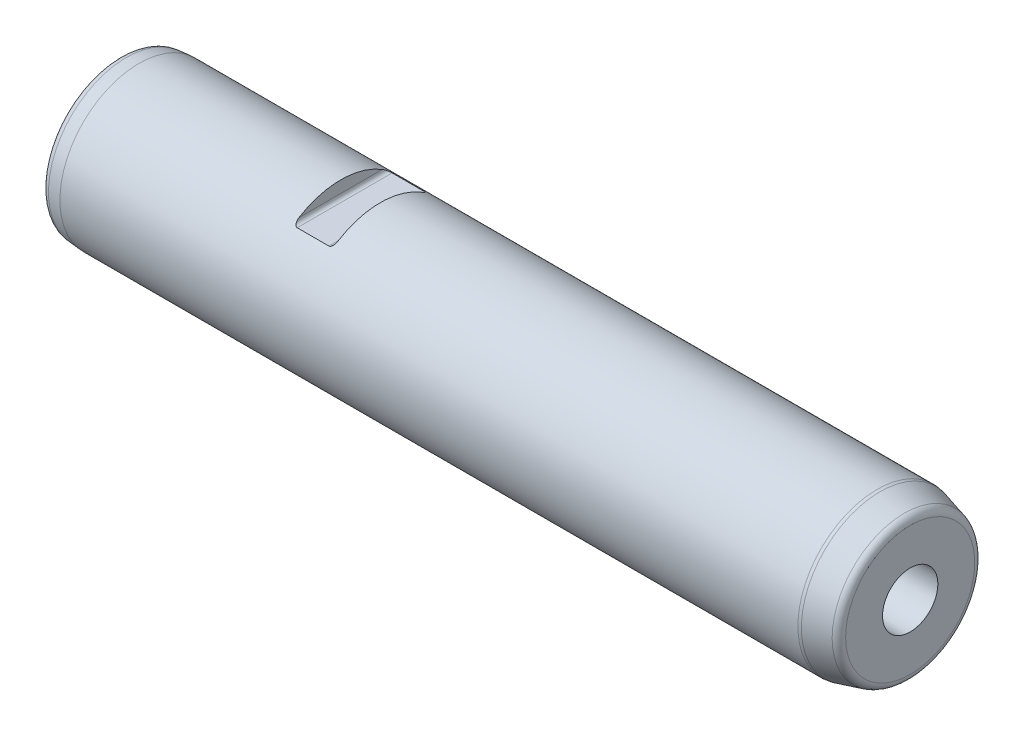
ISO-10303-21;
HEADER;
FILE_DESCRIPTION(('STEP AP214'),'2;1');
FILE_NAME('part.step','',(''),(''),'','','');
FILE_SCHEMA(('AUTOMOTIVE_DESIGN { 1 0 10303 214 1 1 1 1 }'));
ENDSEC;
DATA;
#1=APPLICATION_CONTEXT('core data for automotive mechanical design processes');
#2=APPLICATION_PROTOCOL_DEFINITION('international standard','automotive_design',2000,#1);
#3=PRODUCT_CONTEXT('',#1,'mechanical');
#4=PRODUCT('Part','Part','',(#3));
#5=PRODUCT_RELATED_PRODUCT_CATEGORY('part','',(#4));
#6=PRODUCT_DEFINITION_FORMATION('','',#4);
#7=PRODUCT_DEFINITION_CONTEXT('part definition',#1,'design');
#8=PRODUCT_DEFINITION('design','',#6,#7);
#9=PRODUCT_DEFINITION_SHAPE('','',#8);
#10=(LENGTH_UNIT() NAMED_UNIT(*) SI_UNIT(.MILLI.,.METRE.));
#11=(NAMED_UNIT(*) PLANE_ANGLE_UNIT() SI_UNIT($,.RADIAN.));
#12=(NAMED_UNIT(*) SI_UNIT($,.STERADIAN.) SOLID_ANGLE_UNIT());
#13=UNCERTAINTY_MEASURE_WITH_UNIT(LENGTH_MEASURE(1.E-05),#10,'distance_accuracy_value','');
#14=(GEOMETRIC_REPRESENTATION_CONTEXT(3) GLOBAL_UNCERTAINTY_ASSIGNED_CONTEXT((#13)) GLOBAL_UNIT_ASSIGNED_CONTEXT((#10,
#11,#12)) REPRESENTATION_CONTEXT('',''));
#15=CARTESIAN_POINT('',(0.,0.,0.));
#16=DIRECTION('',(0.,0.,1.));
#17=DIRECTION('',(1.,0.,0.));
#18=AXIS2_PLACEMENT_3D('',#15,#16,#17);
#19=CARTESIAN_POINT('',(0.,0.,0.));
#20=DIRECTION('',(1.,0.,0.));
#21=DIRECTION('',(0.,0.,-1.));
#22=AXIS2_PLACEMENT_3D('',#19,#20,#21);
#23=PLANE('',#22);
#24=CARTESIAN_POINT('',(0.,0.,0.));
#25=DIRECTION('',(1.,0.,0.));
#26=DIRECTION('',(0.,0.,-1.));
#27=AXIS2_PLACEMENT_3D('',#24,#25,#26);
#28=CIRCLE('',#27,17.7298943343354);
#29=CARTESIAN_POINT('',(0.,0.,-17.7298943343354));
#30=VERTEX_POINT('',#29);
#31=EDGE_CURVE('E160',#30,#30,#28,.F.);
#32=ORIENTED_EDGE('',*,*,#31,.T.);
#33=EDGE_LOOP('',(#32));
#34=FACE_BOUND('',#33,.T.);
#35=ADVANCED_FACE('F15',(#34),#23,.F.);
#36=CARTESIAN_POINT('',(0.,0.,0.));
#37=DIRECTION('',(-1.,0.,0.));
#38=DIRECTION('',(0.,0.,1.));
#39=AXIS2_PLACEMENT_3D('',#36,#37,#38);
#40=CYLINDRICAL_SURFACE('',#39,20.);
#41=CARTESIAN_POINT('',(65.,16.,-12.));
#42=CARTESIAN_POINT('',(65.0203975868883,15.9999962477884,-12.0000045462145));
#43=CARTESIAN_POINT('',(65.0407804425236,16.0006247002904,-11.9991670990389));
#44=CARTESIAN_POINT('',(65.0813146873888,16.0031055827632,-11.9958583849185));
#45=CARTESIAN_POINT('',(65.1014663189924,16.004956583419,-11.993389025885));
#46=CARTESIAN_POINT('',(65.1608545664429,16.0122253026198,-11.9836850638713));
#47=CARTESIAN_POINT('',(65.1995323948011,16.0193609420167,-11.9741518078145));
#48=CARTESIAN_POINT('',(65.2739645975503,16.037497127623,-11.9498497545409));
#49=CARTESIAN_POINT('',(65.3097307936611,16.0484809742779,-11.9351035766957));
#50=CARTESIAN_POINT('',(65.3781242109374,16.0735266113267,-11.9013522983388));
#51=CARTESIAN_POINT('',(65.41074138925,16.087597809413,-11.8823341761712));
#52=CARTESIAN_POINT('',(65.4887324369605,16.1259889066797,-11.8302152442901));
#53=CARTESIAN_POINT('',(65.5318948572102,16.1518280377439,-11.7949407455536));
#54=CARTESIAN_POINT('',(65.6109129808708,16.2068340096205,-11.7192462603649));
#55=CARTESIAN_POINT('',(65.6467545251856,16.2360071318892,-11.678816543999));
#56=CARTESIAN_POINT('',(65.7058021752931,16.2906763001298,-11.6023981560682));
#57=CARTESIAN_POINT('',(65.7301168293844,16.3158314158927,-11.567005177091));
#58=CARTESIAN_POINT('',(65.774915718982,16.3670212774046,-11.4944592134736));
#59=CARTESIAN_POINT('',(65.7953974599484,16.3930565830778,-11.4573051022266));
#60=CARTESIAN_POINT('',(65.8518244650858,16.4721604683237,-11.343563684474));
#61=CARTESIAN_POINT('',(65.8825725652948,16.526051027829,-11.2649424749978));
#62=CARTESIAN_POINT('',(65.9240070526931,16.615638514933,-11.1321438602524));
#63=CARTESIAN_POINT('',(65.9379569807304,16.6512330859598,-11.0788360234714));
#64=CARTESIAN_POINT('',(65.9614191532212,16.7223722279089,-10.9711632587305));
#65=CARTESIAN_POINT('',(65.9709289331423,16.7579167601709,-10.9167977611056));
#66=CARTESIAN_POINT('',(65.9857688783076,16.8281581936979,-10.808200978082));
#67=CARTESIAN_POINT('',(65.9911623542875,16.862859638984,-10.7539810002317));
#68=CARTESIAN_POINT('',(65.998268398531,16.9317984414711,-10.6451097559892));
#69=CARTESIAN_POINT('',(65.999986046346,16.9660363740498,-10.5904591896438));
#70=CARTESIAN_POINT('',(66.,17.,-10.5356537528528));
#71=B_SPLINE_CURVE_WITH_KNOTS('',3,(#41,#42,#43,#44,#45,#46,#47,#48,#49,#50,#51,#52,#53,#54,#55,
#56,#57,#58,#59,#60,#61,#62,#63,#64,#65,#66,#67,#68,#69,#70),.UNSPECIFIED.,.F.,.F.,(4,2,2,2,2,2,
2,2,2,2,2,2,2,2,4),(0.,0.0611385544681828,0.122205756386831,0.242843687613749,0.362964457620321,
0.483456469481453,0.66674777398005,0.850390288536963,0.999479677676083,1.14866576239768,
1.44807901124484,1.6447520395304,1.84153410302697,2.03522492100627,2.22864790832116),.UNSPECIFIED.);
#72=CARTESIAN_POINT('',(65.,16.,-12.));
#73=VERTEX_POINT('',#72);
#74=CARTESIAN_POINT('',(66.,17.,-10.5356537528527));
#75=VERTEX_POINT('',#74);
#76=EDGE_CURVE('E206',#73,#75,#71,.T.);
#77=ORIENTED_EDGE('',*,*,#76,.T.);
#78=CARTESIAN_POINT('',(66.,0.,0.));
#79=DIRECTION('',(1.,0.,0.));
#80=DIRECTION('',(0.,0.,-1.));
#81=AXIS2_PLACEMENT_3D('',#78,#79,#80);
#82=CIRCLE('',#81,20.);
#83=CARTESIAN_POINT('',(66.,17.,10.5356537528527));
#84=VERTEX_POINT('',#83);
#85=EDGE_CURVE('E9',#75,#84,#82,.T.);
#86=ORIENTED_EDGE('',*,*,#85,.T.);
#87=CARTESIAN_POINT('',(66.,17.,10.5356537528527));
#88=CARTESIAN_POINT('',(65.9999580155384,16.9556282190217,10.6072606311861));
#89=CARTESIAN_POINT('',(65.9970414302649,16.9107662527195,10.6786284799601));
#90=CARTESIAN_POINT('',(65.9847801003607,16.8201915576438,10.8207316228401));
#91=CARTESIAN_POINT('',(65.9754049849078,16.7744758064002,10.8914623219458));
#92=CARTESIAN_POINT('',(65.9494193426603,16.6823378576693,11.0320779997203));
#93=CARTESIAN_POINT('',(65.9327445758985,16.6359130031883,11.1019496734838));
#94=CARTESIAN_POINT('',(65.8911331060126,16.5434346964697,11.2392876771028));
#95=CARTESIAN_POINT('',(65.8662148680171,16.4973806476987,11.3067590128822));
#96=CARTESIAN_POINT('',(65.8154112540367,16.4198497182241,11.4189199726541));
#97=CARTESIAN_POINT('',(65.7919526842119,16.3880587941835,11.4644877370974));
#98=CARTESIAN_POINT('',(65.739534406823,16.3256491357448,11.5531862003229));
#99=CARTESIAN_POINT('',(65.7105793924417,16.2950294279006,11.596318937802));
#100=CARTESIAN_POINT('',(65.6461040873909,16.2354774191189,11.6795510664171));
#101=CARTESIAN_POINT('',(65.610528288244,16.2065623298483,11.7196204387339));
#102=CARTESIAN_POINT('',(65.5321445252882,16.1520057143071,11.7946959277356));
#103=CARTESIAN_POINT('',(65.489347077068,16.1263595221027,11.829709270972));
#104=CARTESIAN_POINT('',(65.4114116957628,16.0878834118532,11.8819483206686));
#105=CARTESIAN_POINT('',(65.3783803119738,16.0736117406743,11.9012377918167));
#106=CARTESIAN_POINT('',(65.3090792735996,16.048251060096,11.9354131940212));
#107=CARTESIAN_POINT('',(65.2728207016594,16.0371516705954,11.9503134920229));
#108=CARTESIAN_POINT('',(65.1981046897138,16.0190813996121,11.9745255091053));
#109=CARTESIAN_POINT('',(65.1596911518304,16.0120479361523,11.9839219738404));
#110=CARTESIAN_POINT('',(65.10072428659,16.0048841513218,11.9934856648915));
#111=CARTESIAN_POINT('',(65.0807179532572,16.0030600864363,11.9959190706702));
#112=CARTESIAN_POINT('',(65.040479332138,16.0006154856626,11.9991793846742));
#113=CARTESIAN_POINT('',(65.0202468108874,15.9999963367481,12.0000044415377));
#114=CARTESIAN_POINT('',(65.,16.,12.));
#115=B_SPLINE_CURVE_WITH_KNOTS('',3,(#87,#88,#89,#90,#91,#92,#93,#94,#95,#96,#97,#98,#99,#100,
#101,#102,#103,#104,#105,#106,#107,#108,#109,#110,#111,#112,#113,#114),.UNSPECIFIED.,.F.,.F.,(4,
2,2,2,2,2,2,2,2,2,2,2,2,4),(0.,0.252754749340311,0.506706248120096,0.762939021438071,
1.01860168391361,1.19928577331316,1.37981627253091,1.56193473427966,1.74379026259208,
1.86586776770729,1.98754112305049,2.10728809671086,2.16790599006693,2.22859361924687),.UNSPECIFIED.);
#116=CARTESIAN_POINT('',(65.,16.,12.));
#117=VERTEX_POINT('',#116);
#118=EDGE_CURVE('E23',#84,#117,#115,.T.);
#119=ORIENTED_EDGE('',*,*,#118,.T.);
#120=DIRECTION('',(-1.,0.,0.));
#121=VECTOR('',#120,1.);
#122=CARTESIAN_POINT('',(0.,16.,12.));
#123=LINE('',#122,#121);
#124=CARTESIAN_POINT('',(57.,16.,12.));
#125=VERTEX_POINT('',#124);
#126=EDGE_CURVE('E74',#117,#125,#123,.T.);
#127=ORIENTED_EDGE('',*,*,#126,.T.);
#128=CARTESIAN_POINT('',(57.,16.,12.));
#129=CARTESIAN_POINT('',(56.9796024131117,15.9999962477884,12.0000045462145));
#130=CARTESIAN_POINT('',(56.9592195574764,16.0006247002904,11.9991670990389));
#131=CARTESIAN_POINT('',(56.9186853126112,16.0031055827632,11.9958583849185));
#132=CARTESIAN_POINT('',(56.8985336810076,16.004956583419,11.993389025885));
#133=CARTESIAN_POINT('',(56.839145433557,16.0122253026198,11.9836850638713));
#134=CARTESIAN_POINT('',(56.8004676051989,16.0193609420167,11.9741518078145));
#135=CARTESIAN_POINT('',(56.7260354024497,16.037497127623,11.9498497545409));
#136=CARTESIAN_POINT('',(56.6902692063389,16.0484809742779,11.9351035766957));
#137=CARTESIAN_POINT('',(56.6218757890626,16.0735266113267,11.9013522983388));
#138=CARTESIAN_POINT('',(56.58925861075,16.087597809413,11.8823341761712));
#139=CARTESIAN_POINT('',(56.5112675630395,16.1259889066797,11.8302152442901));
#140=CARTESIAN_POINT('',(56.4681051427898,16.1518280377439,11.7949407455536));
#141=CARTESIAN_POINT('',(56.3890870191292,16.2068340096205,11.7192462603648));
#142=CARTESIAN_POINT('',(56.3532454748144,16.2360071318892,11.678816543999));
#143=CARTESIAN_POINT('',(56.2941978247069,16.2906763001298,11.6023981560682));
#144=CARTESIAN_POINT('',(56.2698831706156,16.3158314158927,11.567005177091));
#145=CARTESIAN_POINT('',(56.225084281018,16.3670212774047,11.4944592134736));
#146=CARTESIAN_POINT('',(56.2046025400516,16.3930565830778,11.4573051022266));
#147=CARTESIAN_POINT('',(56.1481755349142,16.4721604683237,11.343563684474));
#148=CARTESIAN_POINT('',(56.1174274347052,16.5260510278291,11.2649424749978));
#149=CARTESIAN_POINT('',(56.0759929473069,16.6156385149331,11.1321438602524));
#150=CARTESIAN_POINT('',(56.0620430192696,16.6512330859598,11.0788360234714));
#151=CARTESIAN_POINT('',(56.0385808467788,16.7223722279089,10.9711632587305));
#152=CARTESIAN_POINT('',(56.0290710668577,16.7579167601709,10.9167977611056));
#153=CARTESIAN_POINT('',(56.0142311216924,16.8281581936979,10.808200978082));
#154=CARTESIAN_POINT('',(56.0088376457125,16.862859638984,10.7539810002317));
#155=CARTESIAN_POINT('',(56.001731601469,16.9317984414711,10.6451097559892));
#156=CARTESIAN_POINT('',(56.000013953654,16.9660363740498,10.5904591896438));
#157=CARTESIAN_POINT('',(56.,17.,10.5356537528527));
#158=B_SPLINE_CURVE_WITH_KNOTS('',3,(#128,#129,#130,#131,#132,#133,#134,#135,#136,#137,#138,
#139,#140,#141,#142,#143,#144,#145,#146,#147,#148,#149,#150,#151,#152,#153,#154,#155,#156,#157),
.UNSPECIFIED.,.F.,.F.,(4,2,2,2,2,2,2,2,2,2,2,2,2,2,4),(0.,0.061138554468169,0.122205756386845,
0.242843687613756,0.362964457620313,0.483456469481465,0.666747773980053,0.850390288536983,
0.999479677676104,1.14866576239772,1.4480790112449,1.64475203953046,1.841534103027,
2.03522492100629,2.22864790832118),.UNSPECIFIED.);
#159=CARTESIAN_POINT('',(56.,17.,10.5356537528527));
#160=VERTEX_POINT('',#159);
#161=EDGE_CURVE('E65',#125,#160,#158,.T.);
#162=ORIENTED_EDGE('',*,*,#161,.T.);
#163=CARTESIAN_POINT('',(56.,0.,0.));
#164=DIRECTION('',(-1.,0.,0.));
#165=DIRECTION('',(0.,0.,1.));
#166=AXIS2_PLACEMENT_3D('',#163,#164,#165);
#167=CIRCLE('',#166,20.);
#168=CARTESIAN_POINT('',(56.,17.,-10.5356537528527));
#169=VERTEX_POINT('',#168);
#170=EDGE_CURVE('E54',#160,#169,#167,.T.);
#171=ORIENTED_EDGE('',*,*,#170,.T.);
#172=CARTESIAN_POINT('',(56.,17.,-10.5356537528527));
#173=CARTESIAN_POINT('',(56.0000419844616,16.9556282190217,-10.6072606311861));
#174=CARTESIAN_POINT('',(56.0029585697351,16.9107662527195,-10.6786284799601));
#175=CARTESIAN_POINT('',(56.0152198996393,16.8201915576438,-10.8207316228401));
#176=CARTESIAN_POINT('',(56.0245950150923,16.7744758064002,-10.8914623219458));
#177=CARTESIAN_POINT('',(56.0505806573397,16.6823378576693,-11.0320779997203));
#178=CARTESIAN_POINT('',(56.0672554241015,16.6359130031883,-11.1019496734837));
#179=CARTESIAN_POINT('',(56.1088668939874,16.5434346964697,-11.2392876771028));
#180=CARTESIAN_POINT('',(56.1337851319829,16.4973806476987,-11.3067590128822));
#181=CARTESIAN_POINT('',(56.1845887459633,16.4198497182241,-11.4189199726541));
#182=CARTESIAN_POINT('',(56.2080473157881,16.3880587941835,-11.4644877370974));
#183=CARTESIAN_POINT('',(56.260465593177,16.3256491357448,-11.5531862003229));
#184=CARTESIAN_POINT('',(56.2894206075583,16.2950294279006,-11.596318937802));
#185=CARTESIAN_POINT('',(56.3538959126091,16.2354774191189,-11.6795510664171));
#186=CARTESIAN_POINT('',(56.389471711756,16.2065623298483,-11.719620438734));
#187=CARTESIAN_POINT('',(56.4678554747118,16.1520057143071,-11.7946959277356));
#188=CARTESIAN_POINT('',(56.510652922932,16.1263595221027,-11.829709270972));
#189=CARTESIAN_POINT('',(56.5885883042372,16.0878834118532,-11.8819483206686));
#190=CARTESIAN_POINT('',(56.6216196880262,16.0736117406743,-11.9012377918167));
#191=CARTESIAN_POINT('',(56.6909207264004,16.048251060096,-11.9354131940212));
#192=CARTESIAN_POINT('',(56.7271792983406,16.0371516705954,-11.9503134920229));
#193=CARTESIAN_POINT('',(56.8018953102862,16.0190813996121,-11.9745255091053));
#194=CARTESIAN_POINT('',(56.8403088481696,16.0120479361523,-11.9839219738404));
#195=CARTESIAN_POINT('',(56.89927571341,16.0048841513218,-11.9934856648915));
#196=CARTESIAN_POINT('',(56.9192820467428,16.0030600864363,-11.9959190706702));
#197=CARTESIAN_POINT('',(56.959520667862,16.0006154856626,-11.9991793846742));
#198=CARTESIAN_POINT('',(56.9797531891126,15.9999963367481,-12.0000044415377));
#199=CARTESIAN_POINT('',(57.,16.,-12.));
#200=B_SPLINE_CURVE_WITH_KNOTS('',3,(#172,#173,#174,#175,#176,#177,#178,#179,#180,#181,#182,
#183,#184,#185,#186,#187,#188,#189,#190,#191,#192,#193,#194,#195,#196,#197,#198,#199),
.UNSPECIFIED.,.F.,.F.,(4,2,2,2,2,2,2,2,2,2,2,2,2,4),(0.,0.252754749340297,0.50670624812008,
0.76293902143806,1.0186016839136,1.19928577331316,1.37981627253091,1.56193473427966,
1.74379026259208,1.86586776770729,1.98754112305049,2.10728809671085,2.16790599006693,
2.22859361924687),.UNSPECIFIED.);
#201=CARTESIAN_POINT('',(57.,16.,-12.));
#202=VERTEX_POINT('',#201);
#203=EDGE_CURVE('E59',#169,#202,#200,.T.);
#204=ORIENTED_EDGE('',*,*,#203,.T.);
#205=DIRECTION('',(-1.,0.,0.));
#206=VECTOR('',#205,1.);
#207=CARTESIAN_POINT('',(0.,16.,-12.));
#208=LINE('',#207,#206);
#209=EDGE_CURVE('E75',#202,#73,#208,.F.);
#210=ORIENTED_EDGE('',*,*,#209,.T.);
#211=EDGE_LOOP('',(#77,#86,#119,#127,#162,#171,#204,#210));
#212=FACE_BOUND('',#211,.T.);
#213=CARTESIAN_POINT('',(5.00000000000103,0.,0.));
#214=DIRECTION('',(1.,0.,0.));
#215=DIRECTION('',(0.,0.,-1.));
#216=AXIS2_PLACEMENT_3D('',#213,#214,#215);
#217=CIRCLE('',#216,20.);
#218=CARTESIAN_POINT('',(5.00000000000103,0.,-20.));
#219=VERTEX_POINT('',#218);
#220=EDGE_CURVE('E159',#219,#219,#217,.T.);
#221=ORIENTED_EDGE('',*,*,#220,.T.);
#222=EDGE_LOOP('',(#221));
#223=FACE_BOUND('',#222,.T.);
#224=CARTESIAN_POINT('',(191.605042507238,0.,0.));
#225=DIRECTION('',(1.,0.,0.));
#226=DIRECTION('',(0.,0.,-1.));
#227=AXIS2_PLACEMENT_3D('',#224,#225,#226);
#228=CIRCLE('',#227,20.);
#229=CARTESIAN_POINT('',(191.605042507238,0.,-20.));
#230=VERTEX_POINT('',#229);
#231=EDGE_CURVE('E177',#230,#230,#228,.F.);
#232=ORIENTED_EDGE('',*,*,#231,.T.);
#233=EDGE_LOOP('',(#232));
#234=FACE_BOUND('',#233,.T.);
#235=ADVANCED_FACE('F71',(#212,#223,#234),#40,.T.);
#236=CARTESIAN_POINT('',(200.,0.,0.));
#237=DIRECTION('',(-1.,0.,0.));
#238=DIRECTION('',(0.,0.,1.));
#239=AXIS2_PLACEMENT_3D('',#236,#237,#238);
#240=CONICAL_SURFACE('',#239,17.856406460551,0.26179938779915);
#241=CARTESIAN_POINT('',(198.517638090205,0.,0.));
#242=DIRECTION('',(1.,0.,0.));
#243=DIRECTION('',(0.,0.,-1.));
#244=AXIS2_PLACEMENT_3D('',#241,#242,#243);
#245=CIRCLE('',#244,18.2536041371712);
#246=CARTESIAN_POINT('',(198.517638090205,0.,-18.2536041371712));
#247=VERTEX_POINT('',#246);
#248=EDGE_CURVE('E165',#247,#247,#245,.F.);
#249=ORIENTED_EDGE('',*,*,#248,.T.);
#250=EDGE_LOOP('',(#249));
#251=FACE_BOUND('',#250,.T.);
#252=CARTESIAN_POINT('',(192.381499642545,0.,0.));
#253=DIRECTION('',(1.,0.,0.));
#254=DIRECTION('',(0.,0.,-1.));
#255=AXIS2_PLACEMENT_3D('',#252,#253,#254);
#256=CIRCLE('',#255,19.8977774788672);
#257=CARTESIAN_POINT('',(192.381499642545,0.,-19.8977774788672));
#258=VERTEX_POINT('',#257);
#259=EDGE_CURVE('E190',#258,#258,#256,.T.);
#260=ORIENTED_EDGE('',*,*,#259,.T.);
#261=EDGE_LOOP('',(#260));
#262=FACE_BOUND('',#261,.T.);
#263=ADVANCED_FACE('F122',(#251,#262),#240,.T.);
#264=CARTESIAN_POINT('',(200.,17.856406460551,0.));
#265=DIRECTION('',(-1.,0.,0.));
#266=DIRECTION('',(0.,0.,1.));
#267=AXIS2_PLACEMENT_3D('',#264,#265,#266);
#268=PLANE('',#267);
#269=CARTESIAN_POINT('',(200.,0.,0.));
#270=DIRECTION('',(1.,0.,0.));
#271=DIRECTION('',(0.,0.,-1.));
#272=AXIS2_PLACEMENT_3D('',#269,#270,#271);
#273=CIRCLE('',#272,7.);
#274=CARTESIAN_POINT('',(200.,0.,-7.));
#275=VERTEX_POINT('',#274);
#276=EDGE_CURVE('E180',#275,#275,#273,.T.);
#277=ORIENTED_EDGE('',*,*,#276,.F.);
#278=EDGE_LOOP('',(#277));
#279=FACE_BOUND('',#278,.T.);
#280=CARTESIAN_POINT('',(200.,0.,0.));
#281=DIRECTION('',(-1.,0.,0.));
#282=DIRECTION('',(0.,0.,1.));
#283=AXIS2_PLACEMENT_3D('',#280,#281,#282);
#284=CIRCLE('',#283,16.3217524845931);
#285=CARTESIAN_POINT('',(200.,0.,16.3217524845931));
#286=VERTEX_POINT('',#285);
#287=EDGE_CURVE('E161',#286,#286,#284,.F.);
#288=ORIENTED_EDGE('',*,*,#287,.T.);
#289=EDGE_LOOP('',(#288));
#290=FACE_BOUND('',#289,.T.);
#291=ADVANCED_FACE('F119',(#279,#290),#268,.F.);
#292=CARTESIAN_POINT('',(191.605042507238,0.,0.));
#293=DIRECTION('',(1.,0.,0.));
#294=DIRECTION('',(0.,0.,-1.));
#295=AXIS2_PLACEMENT_3D('',#292,#293,#294);
#296=TOROIDAL_SURFACE('',#295,17.,3.);
#297=ORIENTED_EDGE('',*,*,#259,.F.);
#298=EDGE_LOOP('',(#297));
#299=FACE_BOUND('',#298,.T.);
#300=ORIENTED_EDGE('',*,*,#231,.F.);
#301=EDGE_LOOP('',(#300));
#302=FACE_BOUND('',#301,.T.);
#303=ADVANCED_FACE('F121',(#299,#302),#296,.T.);
#304=CARTESIAN_POINT('',(198.,0.,0.));
#305=DIRECTION('',(-1.,0.,0.));
#306=DIRECTION('',(0.,0.,1.));
#307=AXIS2_PLACEMENT_3D('',#304,#305,#306);
#308=TOROIDAL_SURFACE('',#307,16.3217524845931,2.);
#309=ORIENTED_EDGE('',*,*,#287,.F.);
#310=EDGE_LOOP('',(#309));
#311=FACE_BOUND('',#310,.T.);
#312=ORIENTED_EDGE('',*,*,#248,.F.);
#313=EDGE_LOOP('',(#312));
#314=FACE_BOUND('',#313,.T.);
#315=ADVANCED_FACE('F142',(#311,#314),#308,.T.);
#316=CARTESIAN_POINT('',(0.,0.,0.));
#317=DIRECTION('',(1.,0.,0.));
#318=DIRECTION('',(0.,0.,-1.));
#319=AXIS2_PLACEMENT_3D('',#316,#317,#318);
#320=CONICAL_SURFACE('',#319,19.5625566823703,0.087266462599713);
#321=CARTESIAN_POINT('',(1.82568851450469,0.,0.));
#322=DIRECTION('',(1.,0.,0.));
#323=DIRECTION('',(0.,0.,-1.));
#324=AXIS2_PLACEMENT_3D('',#321,#322,#323);
#325=CIRCLE('',#324,19.7222837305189);
#326=CARTESIAN_POINT('',(1.82568851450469,0.,-19.7222837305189));
#327=VERTEX_POINT('',#326);
#328=EDGE_CURVE('E60',#327,#327,#325,.T.);
#329=ORIENTED_EDGE('',*,*,#328,.T.);
#330=EDGE_LOOP('',(#329));
#331=FACE_BOUND('',#330,.T.);
#332=ORIENTED_EDGE('',*,*,#220,.F.);
#333=EDGE_LOOP('',(#332));
#334=FACE_BOUND('',#333,.T.);
#335=ADVANCED_FACE('F145',(#331,#334),#320,.T.);
#336=CARTESIAN_POINT('',(2.,0.,0.));
#337=DIRECTION('',(1.,0.,0.));
#338=DIRECTION('',(0.,0.,-1.));
#339=AXIS2_PLACEMENT_3D('',#336,#337,#338);
#340=TOROIDAL_SURFACE('',#339,17.7298943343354,2.);
#341=ORIENTED_EDGE('',*,*,#328,.F.);
#342=EDGE_LOOP('',(#341));
#343=FACE_BOUND('',#342,.T.);
#344=ORIENTED_EDGE('',*,*,#31,.F.);
#345=EDGE_LOOP('',(#344));
#346=FACE_BOUND('',#345,.T.);
#347=ADVANCED_FACE('F17',(#343,#346),#340,.T.);
#348=CARTESIAN_POINT('',(176.,0.,0.));
#349=DIRECTION('',(1.,0.,0.));
#350=DIRECTION('',(0.,0.,-1.));
#351=AXIS2_PLACEMENT_3D('',#348,#349,#350);
#352=PLANE('',#351);
#353=CARTESIAN_POINT('',(176.,0.,0.));
#354=DIRECTION('',(1.,0.,0.));
#355=DIRECTION('',(0.,0.,-1.));
#356=AXIS2_PLACEMENT_3D('',#353,#354,#355);
#357=CIRCLE('',#356,7.);
#358=CARTESIAN_POINT('',(176.,0.,-7.));
#359=VERTEX_POINT('',#358);
#360=EDGE_CURVE('E173',#359,#359,#357,.T.);
#361=ORIENTED_EDGE('',*,*,#360,.T.);
#362=EDGE_LOOP('',(#361));
#363=FACE_BOUND('',#362,.T.);
#364=CARTESIAN_POINT('',(176.,0.,0.));
#365=DIRECTION('',(1.,0.,0.));
#366=DIRECTION('',(0.,0.,-1.));
#367=AXIS2_PLACEMENT_3D('',#364,#365,#366);
#368=CIRCLE('',#367,5.1);
#369=CARTESIAN_POINT('',(176.,0.,-5.1));
#370=VERTEX_POINT('',#369);
#371=EDGE_CURVE('E170',#370,#370,#368,.F.);
#372=ORIENTED_EDGE('',*,*,#371,.T.);
#373=EDGE_LOOP('',(#372));
#374=FACE_BOUND('',#373,.T.);
#375=ADVANCED_FACE('F103',(#363,#374),#352,.T.);
#376=CARTESIAN_POINT('',(176.,0.,0.));
#377=DIRECTION('',(1.,0.,0.));
#378=DIRECTION('',(0.,0.,-1.));
#379=AXIS2_PLACEMENT_3D('',#376,#377,#378);
#380=CYLINDRICAL_SURFACE('',#379,7.);
#381=ORIENTED_EDGE('',*,*,#360,.F.);
#382=EDGE_LOOP('',(#381));
#383=FACE_BOUND('',#382,.T.);
#384=ORIENTED_EDGE('',*,*,#276,.T.);
#385=EDGE_LOOP('',(#384));
#386=FACE_BOUND('',#385,.T.);
#387=ADVANCED_FACE('F106',(#383,#386),#380,.F.);
#388=CARTESIAN_POINT('',(170.,0.,0.));
#389=DIRECTION('',(1.,0.,0.));
#390=DIRECTION('',(0.,0.,-1.));
#391=AXIS2_PLACEMENT_3D('',#388,#389,#390);
#392=CONICAL_SURFACE('',#391,5.1,1.0471975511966);
#393=CARTESIAN_POINT('',(167.055513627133,0.,0.));
#394=VERTEX_POINT('',#393);
#395=VERTEX_LOOP('',#394);
#396=FACE_BOUND('',#395,.T.);
#397=CARTESIAN_POINT('',(170.,0.,0.));
#398=DIRECTION('',(1.,0.,0.));
#399=DIRECTION('',(0.,0.,-1.));
#400=AXIS2_PLACEMENT_3D('',#397,#398,#399);
#401=CIRCLE('',#400,5.1);
#402=CARTESIAN_POINT('',(170.,0.,-5.1));
#403=VERTEX_POINT('',#402);
#404=EDGE_CURVE('E172',#403,#403,#401,.T.);
#405=ORIENTED_EDGE('',*,*,#404,.T.);
#406=EDGE_LOOP('',(#405));
#407=FACE_BOUND('',#406,.T.);
#408=ADVANCED_FACE('F110',(#396,#407),#392,.F.);
#409=CARTESIAN_POINT('',(200.,0.,0.));
#410=DIRECTION('',(1.,0.,0.));
#411=DIRECTION('',(0.,0.,-1.));
#412=AXIS2_PLACEMENT_3D('',#409,#410,#411);
#413=CYLINDRICAL_SURFACE('',#412,5.1);
#414=ORIENTED_EDGE('',*,*,#404,.F.);
#415=EDGE_LOOP('',(#414));
#416=FACE_BOUND('',#415,.T.);
#417=ORIENTED_EDGE('',*,*,#371,.F.);
#418=EDGE_LOOP('',(#417));
#419=FACE_BOUND('',#418,.T.);
#420=ADVANCED_FACE('F112',(#416,#419),#413,.F.);
#421=CARTESIAN_POINT('',(66.,17.,-20.));
#422=DIRECTION('',(1.,0.,0.));
#423=DIRECTION('',(0.,0.,-1.));
#424=AXIS2_PLACEMENT_3D('',#421,#422,#423);
#425=PLANE('',#424);
#426=DIRECTION('',(0.,0.,1.));
#427=VECTOR('',#426,1.);
#428=CARTESIAN_POINT('',(66.,17.,-20.));
#429=LINE('',#428,#427);
#430=EDGE_CURVE('E184',#75,#84,#429,.T.);
#431=ORIENTED_EDGE('',*,*,#430,.T.);
#432=ORIENTED_EDGE('',*,*,#85,.F.);
#433=EDGE_LOOP('',(#431,#432));
#434=FACE_BOUND('',#433,.T.);
#435=ADVANCED_FACE('F115',(#434),#425,.F.);
#436=CARTESIAN_POINT('',(65.,17.,-20.));
#437=DIRECTION('',(0.,0.,1.));
#438=DIRECTION('',(1.,0.,0.));
#439=AXIS2_PLACEMENT_3D('',#436,#437,#438);
#440=CYLINDRICAL_SURFACE('',#439,1.);
#441=ORIENTED_EDGE('',*,*,#430,.F.);
#442=ORIENTED_EDGE('',*,*,#76,.F.);
#443=DIRECTION('',(0.,0.,1.));
#444=VECTOR('',#443,1.);
#445=CARTESIAN_POINT('',(65.,16.,-20.));
#446=LINE('',#445,#444);
#447=EDGE_CURVE('E199',#73,#117,#446,.T.);
#448=ORIENTED_EDGE('',*,*,#447,.T.);
#449=ORIENTED_EDGE('',*,*,#118,.F.);
#450=EDGE_LOOP('',(#441,#442,#448,#449));
#451=FACE_BOUND('',#450,.T.);
#452=ADVANCED_FACE('F217',(#451),#440,.F.);
#453=CARTESIAN_POINT('',(57.,16.,-20.));
#454=DIRECTION('',(0.,-1.,0.));
#455=DIRECTION('',(0.,0.,-1.));
#456=AXIS2_PLACEMENT_3D('',#453,#454,#455);
#457=PLANE('',#456);
#458=ORIENTED_EDGE('',*,*,#447,.F.);
#459=ORIENTED_EDGE('',*,*,#209,.F.);
#460=DIRECTION('',(0.,0.,1.));
#461=VECTOR('',#460,1.);
#462=CARTESIAN_POINT('',(57.,16.,-20.));
#463=LINE('',#462,#461);
#464=EDGE_CURVE('E67',#202,#125,#463,.T.);
#465=ORIENTED_EDGE('',*,*,#464,.T.);
#466=ORIENTED_EDGE('',*,*,#126,.F.);
#467=EDGE_LOOP('',(#458,#459,#465,#466));
#468=FACE_BOUND('',#467,.T.);
#469=ADVANCED_FACE('F98',(#468),#457,.F.);
#470=CARTESIAN_POINT('',(57.,17.,-20.));
#471=DIRECTION('',(0.,0.,1.));
#472=DIRECTION('',(1.,0.,0.));
#473=AXIS2_PLACEMENT_3D('',#470,#471,#472);
#474=CYLINDRICAL_SURFACE('',#473,1.);
#475=ORIENTED_EDGE('',*,*,#464,.F.);
#476=ORIENTED_EDGE('',*,*,#203,.F.);
#477=DIRECTION('',(0.,0.,1.));
#478=VECTOR('',#477,1.);
#479=CARTESIAN_POINT('',(56.,17.,-20.));
#480=LINE('',#479,#478);
#481=EDGE_CURVE('E29',#169,#160,#480,.T.);
#482=ORIENTED_EDGE('',*,*,#481,.T.);
#483=ORIENTED_EDGE('',*,*,#161,.F.);
#484=EDGE_LOOP('',(#475,#476,#482,#483));
#485=FACE_BOUND('',#484,.T.);
#486=ADVANCED_FACE('F64',(#485),#474,.F.);
#487=CARTESIAN_POINT('',(56.,20.,-20.));
#488=DIRECTION('',(-1.,0.,0.));
#489=DIRECTION('',(0.,0.,1.));
#490=AXIS2_PLACEMENT_3D('',#487,#488,#489);
#491=PLANE('',#490);
#492=ORIENTED_EDGE('',*,*,#481,.F.);
#493=ORIENTED_EDGE('',*,*,#170,.F.);
#494=EDGE_LOOP('',(#492,#493));
#495=FACE_BOUND('',#494,.T.);
#496=ADVANCED_FACE('F55',(#495),#491,.F.);
#497=CLOSED_SHELL('',(#35,#235,#263,#291,#303,#315,#335,#347,#375,#387,#408,#420,#435,#452,#469,
#486,#496));
#498=MANIFOLD_SOLID_BREP('B1',#497);
#499=ADVANCED_BREP_SHAPE_REPRESENTATION('',(#18,#498),#14);
#500=SHAPE_DEFINITION_REPRESENTATION(#9,#499);
ENDSEC;
END-ISO-10303-21;
